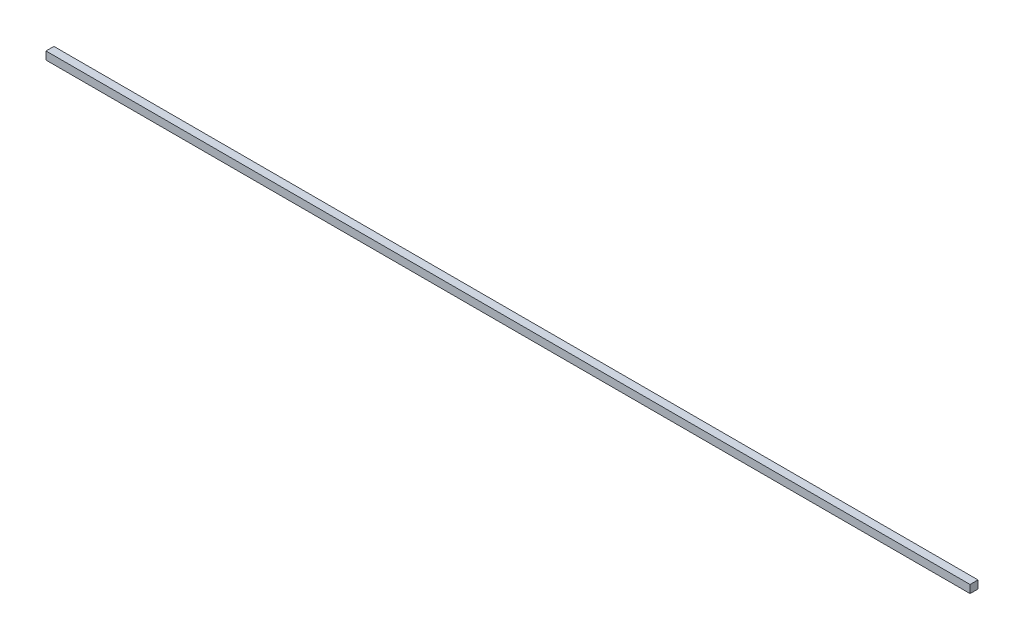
ISO-10303-21;
HEADER;
FILE_DESCRIPTION(('STEP AP214'),'2;1');
FILE_NAME('part.step','',(''),(''),'','','');
FILE_SCHEMA(('AUTOMOTIVE_DESIGN { 1 0 10303 214 1 1 1 1 }'));
ENDSEC;
DATA;
#1=APPLICATION_CONTEXT('core data for automotive mechanical design processes');
#2=APPLICATION_PROTOCOL_DEFINITION('international standard','automotive_design',2000,#1);
#3=PRODUCT_CONTEXT('',#1,'mechanical');
#4=PRODUCT('Part','Part','',(#3));
#5=PRODUCT_RELATED_PRODUCT_CATEGORY('part','',(#4));
#6=PRODUCT_DEFINITION_FORMATION('','',#4);
#7=PRODUCT_DEFINITION_CONTEXT('part definition',#1,'design');
#8=PRODUCT_DEFINITION('design','',#6,#7);
#9=PRODUCT_DEFINITION_SHAPE('','',#8);
#10=(LENGTH_UNIT() NAMED_UNIT(*) SI_UNIT(.MILLI.,.METRE.));
#11=(NAMED_UNIT(*) PLANE_ANGLE_UNIT() SI_UNIT($,.RADIAN.));
#12=(NAMED_UNIT(*) SI_UNIT($,.STERADIAN.) SOLID_ANGLE_UNIT());
#13=UNCERTAINTY_MEASURE_WITH_UNIT(LENGTH_MEASURE(1.E-05),#10,'distance_accuracy_value','');
#14=(GEOMETRIC_REPRESENTATION_CONTEXT(3) GLOBAL_UNCERTAINTY_ASSIGNED_CONTEXT((#13)) GLOBAL_UNIT_ASSIGNED_CONTEXT((#10,
#11,#12)) REPRESENTATION_CONTEXT('',''));
#15=CARTESIAN_POINT('',(0.,0.,0.));
#16=DIRECTION('',(0.,0.,1.));
#17=DIRECTION('',(1.,0.,0.));
#18=AXIS2_PLACEMENT_3D('',#15,#16,#17);
#19=CARTESIAN_POINT('',(0.,0.,3.));
#20=DIRECTION('',(1.,0.,0.));
#21=DIRECTION('',(0.,0.,-1.));
#22=AXIS2_PLACEMENT_3D('',#19,#20,#21);
#23=PLANE('',#22);
#24=DIRECTION('',(0.,-1.,0.));
#25=VECTOR('',#24,1.);
#26=CARTESIAN_POINT('',(0.,0.,0.));
#27=LINE('',#26,#25);
#28=CARTESIAN_POINT('',(0.,3.,0.));
#29=VERTEX_POINT('',#28);
#30=CARTESIAN_POINT('',(0.,0.,0.));
#31=VERTEX_POINT('',#30);
#32=EDGE_CURVE('E70',#29,#31,#27,.T.);
#33=ORIENTED_EDGE('',*,*,#32,.T.);
#34=DIRECTION('',(0.,0.,-1.));
#35=VECTOR('',#34,1.);
#36=CARTESIAN_POINT('',(0.,0.,3.));
#37=LINE('',#36,#35);
#38=CARTESIAN_POINT('',(0.,0.,3.));
#39=VERTEX_POINT('',#38);
#40=EDGE_CURVE('E11',#39,#31,#37,.T.);
#41=ORIENTED_EDGE('',*,*,#40,.F.);
#42=DIRECTION('',(0.,-1.,0.));
#43=VECTOR('',#42,1.);
#44=CARTESIAN_POINT('',(0.,0.,3.));
#45=LINE('',#44,#43);
#46=CARTESIAN_POINT('',(0.,3.,3.));
#47=VERTEX_POINT('',#46);
#48=EDGE_CURVE('E88',#47,#39,#45,.T.);
#49=ORIENTED_EDGE('',*,*,#48,.F.);
#50=DIRECTION('',(0.,0.,-1.));
#51=VECTOR('',#50,1.);
#52=CARTESIAN_POINT('',(0.,3.,3.));
#53=LINE('',#52,#51);
#54=EDGE_CURVE('E82',#47,#29,#53,.T.);
#55=ORIENTED_EDGE('',*,*,#54,.T.);
#56=EDGE_LOOP('',(#33,#41,#49,#55));
#57=FACE_BOUND('',#56,.T.);
#58=ADVANCED_FACE('F26',(#57),#23,.F.);
#59=CARTESIAN_POINT('',(0.,0.,3.));
#60=DIRECTION('',(0.,1.,0.));
#61=DIRECTION('',(0.,0.,1.));
#62=AXIS2_PLACEMENT_3D('',#59,#60,#61);
#63=PLANE('',#62);
#64=DIRECTION('',(1.,0.,0.));
#65=VECTOR('',#64,1.);
#66=CARTESIAN_POINT('',(0.,0.,0.));
#67=LINE('',#66,#65);
#68=CARTESIAN_POINT('',(350.,0.,0.));
#69=VERTEX_POINT('',#68);
#70=EDGE_CURVE('E66',#31,#69,#67,.T.);
#71=ORIENTED_EDGE('',*,*,#70,.T.);
#72=DIRECTION('',(0.,0.,-1.));
#73=VECTOR('',#72,1.);
#74=CARTESIAN_POINT('',(350.,0.,3.));
#75=LINE('',#74,#73);
#76=CARTESIAN_POINT('',(350.,0.,3.));
#77=VERTEX_POINT('',#76);
#78=EDGE_CURVE('E33',#77,#69,#75,.T.);
#79=ORIENTED_EDGE('',*,*,#78,.F.);
#80=DIRECTION('',(1.,0.,0.));
#81=VECTOR('',#80,1.);
#82=CARTESIAN_POINT('',(0.,0.,3.));
#83=LINE('',#82,#81);
#84=EDGE_CURVE('E78',#39,#77,#83,.T.);
#85=ORIENTED_EDGE('',*,*,#84,.F.);
#86=ORIENTED_EDGE('',*,*,#40,.T.);
#87=EDGE_LOOP('',(#71,#79,#85,#86));
#88=FACE_BOUND('',#87,.T.);
#89=ADVANCED_FACE('F77',(#88),#63,.F.);
#90=CARTESIAN_POINT('',(350.,0.,3.));
#91=DIRECTION('',(-1.,0.,0.));
#92=DIRECTION('',(0.,0.,1.));
#93=AXIS2_PLACEMENT_3D('',#90,#91,#92);
#94=PLANE('',#93);
#95=DIRECTION('',(0.,1.,0.));
#96=VECTOR('',#95,1.);
#97=CARTESIAN_POINT('',(350.,0.,0.));
#98=LINE('',#97,#96);
#99=CARTESIAN_POINT('',(350.,3.,0.));
#100=VERTEX_POINT('',#99);
#101=EDGE_CURVE('E71',#69,#100,#98,.T.);
#102=ORIENTED_EDGE('',*,*,#101,.T.);
#103=DIRECTION('',(0.,0.,-1.));
#104=VECTOR('',#103,1.);
#105=CARTESIAN_POINT('',(350.,3.,3.));
#106=LINE('',#105,#104);
#107=CARTESIAN_POINT('',(350.,3.,3.));
#108=VERTEX_POINT('',#107);
#109=EDGE_CURVE('E94',#108,#100,#106,.T.);
#110=ORIENTED_EDGE('',*,*,#109,.F.);
#111=DIRECTION('',(0.,1.,0.));
#112=VECTOR('',#111,1.);
#113=CARTESIAN_POINT('',(350.,0.,3.));
#114=LINE('',#113,#112);
#115=EDGE_CURVE('E45',#77,#108,#114,.T.);
#116=ORIENTED_EDGE('',*,*,#115,.F.);
#117=ORIENTED_EDGE('',*,*,#78,.T.);
#118=EDGE_LOOP('',(#102,#110,#116,#117));
#119=FACE_BOUND('',#118,.T.);
#120=ADVANCED_FACE('F97',(#119),#94,.F.);
#121=CARTESIAN_POINT('',(0.,3.,3.));
#122=DIRECTION('',(0.,-1.,0.));
#123=DIRECTION('',(0.,0.,-1.));
#124=AXIS2_PLACEMENT_3D('',#121,#122,#123);
#125=PLANE('',#124);
#126=DIRECTION('',(-1.,0.,0.));
#127=VECTOR('',#126,1.);
#128=CARTESIAN_POINT('',(0.,3.,0.));
#129=LINE('',#128,#127);
#130=EDGE_CURVE('E86',#100,#29,#129,.T.);
#131=ORIENTED_EDGE('',*,*,#130,.T.);
#132=ORIENTED_EDGE('',*,*,#54,.F.);
#133=DIRECTION('',(-1.,0.,0.));
#134=VECTOR('',#133,1.);
#135=CARTESIAN_POINT('',(0.,3.,3.));
#136=LINE('',#135,#134);
#137=EDGE_CURVE('E40',#108,#47,#136,.T.);
#138=ORIENTED_EDGE('',*,*,#137,.F.);
#139=ORIENTED_EDGE('',*,*,#109,.T.);
#140=EDGE_LOOP('',(#131,#132,#138,#139));
#141=FACE_BOUND('',#140,.T.);
#142=ADVANCED_FACE('F99',(#141),#125,.F.);
#143=CARTESIAN_POINT('',(0.,3.,3.));
#144=DIRECTION('',(0.,0.,-1.));
#145=DIRECTION('',(-1.,0.,0.));
#146=AXIS2_PLACEMENT_3D('',#143,#144,#145);
#147=PLANE('',#146);
#148=ORIENTED_EDGE('',*,*,#48,.T.);
#149=ORIENTED_EDGE('',*,*,#84,.T.);
#150=ORIENTED_EDGE('',*,*,#115,.T.);
#151=ORIENTED_EDGE('',*,*,#137,.T.);
#152=EDGE_LOOP('',(#148,#149,#150,#151));
#153=FACE_BOUND('',#152,.T.);
#154=ADVANCED_FACE('F100',(#153),#147,.F.);
#155=CARTESIAN_POINT('',(0.,3.,0.));
#156=DIRECTION('',(0.,0.,-1.));
#157=DIRECTION('',(-1.,0.,0.));
#158=AXIS2_PLACEMENT_3D('',#155,#156,#157);
#159=PLANE('',#158);
#160=ORIENTED_EDGE('',*,*,#32,.F.);
#161=ORIENTED_EDGE('',*,*,#130,.F.);
#162=ORIENTED_EDGE('',*,*,#101,.F.);
#163=ORIENTED_EDGE('',*,*,#70,.F.);
#164=EDGE_LOOP('',(#160,#161,#162,#163));
#165=FACE_BOUND('',#164,.T.);
#166=ADVANCED_FACE('F67',(#165),#159,.T.);
#167=CLOSED_SHELL('',(#58,#89,#120,#142,#154,#166));
#168=MANIFOLD_SOLID_BREP('B2',#167);
#169=ADVANCED_BREP_SHAPE_REPRESENTATION('',(#18,#168),#14);
#170=SHAPE_DEFINITION_REPRESENTATION(#9,#169);
ENDSEC;
END-ISO-10303-21;
